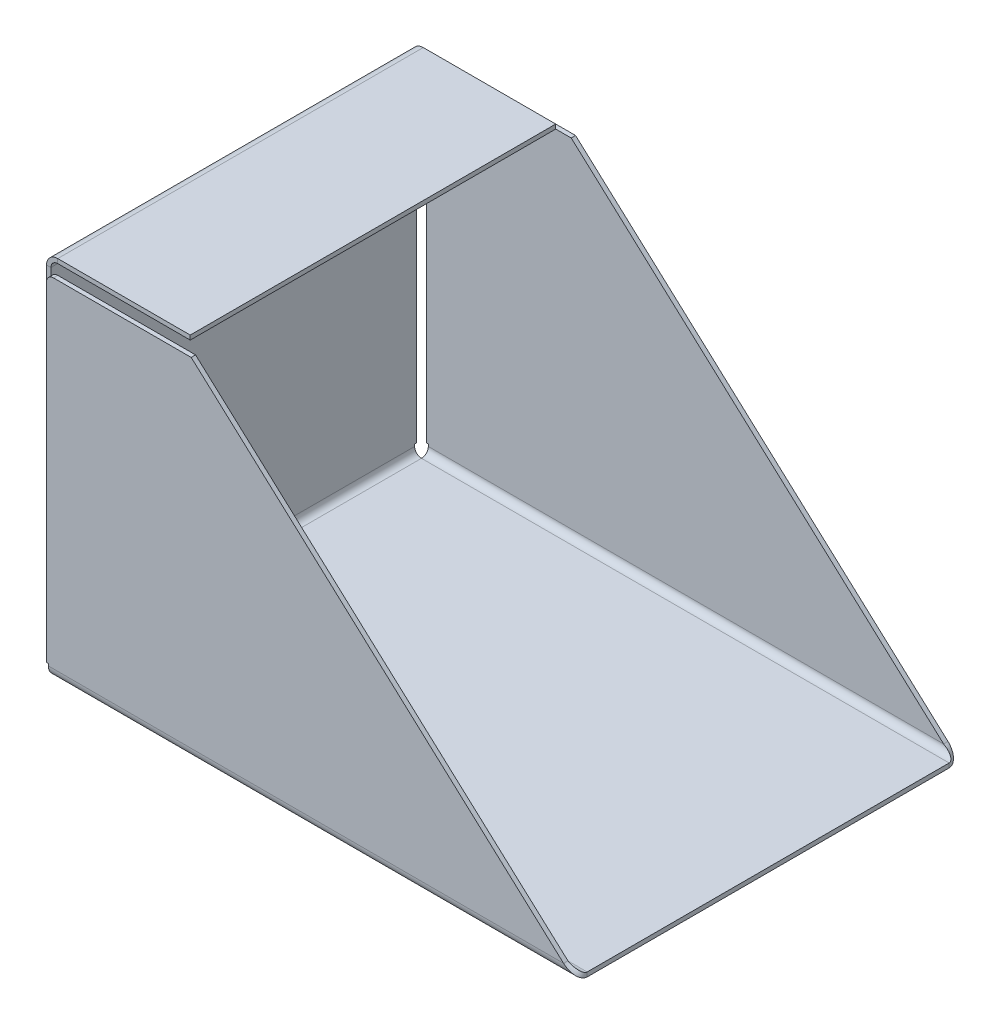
ISO-10303-21;
HEADER;
FILE_DESCRIPTION(('STEP AP214'),'2;1');
FILE_NAME('part.step','',(''),(''),'','','');
FILE_SCHEMA(('AUTOMOTIVE_DESIGN { 1 0 10303 214 1 1 1 1 }'));
ENDSEC;
DATA;
#1=APPLICATION_CONTEXT('core data for automotive mechanical design processes');
#2=APPLICATION_PROTOCOL_DEFINITION('international standard','automotive_design',2000,#1);
#3=PRODUCT_CONTEXT('',#1,'mechanical');
#4=PRODUCT('Part','Part','',(#3));
#5=PRODUCT_RELATED_PRODUCT_CATEGORY('part','',(#4));
#6=PRODUCT_DEFINITION_FORMATION('','',#4);
#7=PRODUCT_DEFINITION_CONTEXT('part definition',#1,'design');
#8=PRODUCT_DEFINITION('design','',#6,#7);
#9=PRODUCT_DEFINITION_SHAPE('','',#8);
#10=(LENGTH_UNIT() NAMED_UNIT(*) SI_UNIT(.MILLI.,.METRE.));
#11=(NAMED_UNIT(*) PLANE_ANGLE_UNIT() SI_UNIT($,.RADIAN.));
#12=(NAMED_UNIT(*) SI_UNIT($,.STERADIAN.) SOLID_ANGLE_UNIT());
#13=UNCERTAINTY_MEASURE_WITH_UNIT(LENGTH_MEASURE(1.E-05),#10,'distance_accuracy_value','');
#14=(GEOMETRIC_REPRESENTATION_CONTEXT(3) GLOBAL_UNCERTAINTY_ASSIGNED_CONTEXT((#13)) GLOBAL_UNIT_ASSIGNED_CONTEXT((#10,
#11,#12)) REPRESENTATION_CONTEXT('',''));
#15=CARTESIAN_POINT('',(0.,0.,0.));
#16=DIRECTION('',(0.,0.,1.));
#17=DIRECTION('',(1.,0.,0.));
#18=AXIS2_PLACEMENT_3D('',#15,#16,#17);
#19=CARTESIAN_POINT('',(3.11911999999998,3.11912,3.11912));
#20=DIRECTION('',(-1.,0.,0.));
#21=DIRECTION('',(0.,0.,1.));
#22=AXIS2_PLACEMENT_3D('',#19,#20,#21);
#23=PLANE('',#22);
#24=DIRECTION('',(0.,-1.,0.));
#25=VECTOR('',#24,1.);
#26=CARTESIAN_POINT('',(3.11911999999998,0.,3.11911999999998));
#27=LINE('',#26,#25);
#28=CARTESIAN_POINT('',(3.11911999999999,1.21412,3.11911999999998));
#29=VERTEX_POINT('',#28);
#30=CARTESIAN_POINT('',(3.11911999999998,0.,3.11911999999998));
#31=VERTEX_POINT('',#30);
#32=EDGE_CURVE('E11',#29,#31,#27,.T.);
#33=ORIENTED_EDGE('',*,*,#32,.F.);
#34=CARTESIAN_POINT('',(3.11911999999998,3.11912,3.11912));
#35=DIRECTION('',(-1.,0.,0.));
#36=DIRECTION('',(0.,0.,1.));
#37=AXIS2_PLACEMENT_3D('',#34,#35,#36);
#38=CIRCLE('',#37,1.905);
#39=CARTESIAN_POINT('',(3.11911999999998,3.11912,1.21412));
#40=VERTEX_POINT('',#39);
#41=EDGE_CURVE('E150',#29,#40,#38,.F.);
#42=ORIENTED_EDGE('',*,*,#41,.T.);
#43=DIRECTION('',(0.,0.,-1.));
#44=VECTOR('',#43,1.);
#45=CARTESIAN_POINT('',(3.11911999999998,3.11912,0.));
#46=LINE('',#45,#44);
#47=CARTESIAN_POINT('',(3.11911999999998,3.11912,0.));
#48=VERTEX_POINT('',#47);
#49=EDGE_CURVE('E44',#40,#48,#46,.T.);
#50=ORIENTED_EDGE('',*,*,#49,.T.);
#51=CARTESIAN_POINT('',(3.11911999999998,3.11912,3.11912));
#52=DIRECTION('',(1.,0.,0.));
#53=DIRECTION('',(0.,0.,-1.));
#54=AXIS2_PLACEMENT_3D('',#51,#52,#53);
#55=CIRCLE('',#54,3.11912);
#56=EDGE_CURVE('E153',#31,#48,#55,.T.);
#57=ORIENTED_EDGE('',*,*,#56,.F.);
#58=EDGE_LOOP('',(#33,#42,#50,#57));
#59=FACE_BOUND('',#58,.T.);
#60=ADVANCED_FACE('F34',(#59),#23,.T.);
#61=CARTESIAN_POINT('',(3.11911999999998,0.,0.));
#62=DIRECTION('',(1.,0.,0.));
#63=DIRECTION('',(0.,-1.,0.));
#64=AXIS2_PLACEMENT_3D('',#61,#62,#63);
#65=PLANE('',#64);
#66=ORIENTED_EDGE('',*,*,#49,.F.);
#67=DIRECTION('',(0.,1.,0.));
#68=VECTOR('',#67,1.);
#69=CARTESIAN_POINT('',(3.11911999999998,0.,1.21412));
#70=LINE('',#69,#68);
#71=CARTESIAN_POINT('',(3.11911999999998,3.716490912,1.21412));
#72=VERTEX_POINT('',#71);
#73=EDGE_CURVE('E350',#72,#40,#70,.F.);
#74=ORIENTED_EDGE('',*,*,#73,.F.);
#75=DIRECTION('',(0.,0.,-1.));
#76=VECTOR('',#75,1.);
#77=CARTESIAN_POINT('',(3.11911999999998,3.716490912,0.));
#78=LINE('',#77,#76);
#79=CARTESIAN_POINT('',(3.11911999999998,3.716490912,0.));
#80=VERTEX_POINT('',#79);
#81=EDGE_CURVE('E276',#72,#80,#78,.T.);
#82=ORIENTED_EDGE('',*,*,#81,.T.);
#83=DIRECTION('',(0.,-1.,0.));
#84=VECTOR('',#83,1.);
#85=CARTESIAN_POINT('',(3.11911999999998,0.,0.));
#86=LINE('',#85,#84);
#87=EDGE_CURVE('E299',#80,#48,#86,.T.);
#88=ORIENTED_EDGE('',*,*,#87,.T.);
#89=EDGE_LOOP('',(#66,#74,#82,#88));
#90=FACE_BOUND('',#89,.T.);
#91=ADVANCED_FACE('F300',(#90),#65,.F.);
#92=CARTESIAN_POINT('',(0.,3.716490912,0.));
#93=DIRECTION('',(0.,-1.,0.));
#94=DIRECTION('',(-1.,0.,0.));
#95=AXIS2_PLACEMENT_3D('',#92,#93,#94);
#96=PLANE('',#95);
#97=ORIENTED_EDGE('',*,*,#81,.F.);
#98=DIRECTION('',(-1.,0.,0.));
#99=VECTOR('',#98,1.);
#100=CARTESIAN_POINT('',(0.,3.716490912,1.21412));
#101=LINE('',#100,#99);
#102=CARTESIAN_POINT('',(2.62833356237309,3.71649091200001,1.21412));
#103=VERTEX_POINT('',#102);
#104=EDGE_CURVE('E384',#72,#103,#101,.T.);
#105=ORIENTED_EDGE('',*,*,#104,.T.);
#106=DIRECTION('',(0.,0.,-1.));
#107=VECTOR('',#106,1.);
#108=CARTESIAN_POINT('',(2.62833356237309,3.71649091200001,0.));
#109=LINE('',#108,#107);
#110=CARTESIAN_POINT('',(2.62833356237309,3.71649091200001,0.));
#111=VERTEX_POINT('',#110);
#112=EDGE_CURVE('E273',#103,#111,#109,.T.);
#113=ORIENTED_EDGE('',*,*,#112,.T.);
#114=DIRECTION('',(-1.,0.,0.));
#115=VECTOR('',#114,1.);
#116=CARTESIAN_POINT('',(0.,3.716490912,0.));
#117=LINE('',#116,#115);
#118=EDGE_CURVE('E306',#80,#111,#117,.T.);
#119=ORIENTED_EDGE('',*,*,#118,.F.);
#120=EDGE_LOOP('',(#97,#105,#113,#119));
#121=FACE_BOUND('',#120,.T.);
#122=ADVANCED_FACE('F422',(#121),#96,.T.);
#123=CARTESIAN_POINT('',(2.62833356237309,97.3716664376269,0.));
#124=DIRECTION('',(-1.,0.,0.));
#125=DIRECTION('',(0.,1.,0.));
#126=AXIS2_PLACEMENT_3D('',#123,#124,#125);
#127=PLANE('',#126);
#128=ORIENTED_EDGE('',*,*,#112,.F.);
#129=DIRECTION('',(0.,1.,0.));
#130=VECTOR('',#129,1.);
#131=CARTESIAN_POINT('',(2.62833356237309,0.,1.21412));
#132=LINE('',#131,#130);
#133=CARTESIAN_POINT('',(2.62833356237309,95.4666664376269,1.21412));
#134=VERTEX_POINT('',#133);
#135=EDGE_CURVE('E398',#103,#134,#132,.T.);
#136=ORIENTED_EDGE('',*,*,#135,.T.);
#137=DIRECTION('',(0.,0.,-1.));
#138=VECTOR('',#137,1.);
#139=CARTESIAN_POINT('',(2.62833356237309,95.4666664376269,0.));
#140=LINE('',#139,#138);
#141=CARTESIAN_POINT('',(2.62833356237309,95.4666664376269,0.));
#142=VERTEX_POINT('',#141);
#143=EDGE_CURVE('E270',#134,#142,#140,.T.);
#144=ORIENTED_EDGE('',*,*,#143,.T.);
#145=DIRECTION('',(0.,1.,0.));
#146=VECTOR('',#145,1.);
#147=CARTESIAN_POINT('',(2.62833356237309,97.3716664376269,0.));
#148=LINE('',#147,#146);
#149=EDGE_CURVE('E552',#111,#142,#148,.T.);
#150=ORIENTED_EDGE('',*,*,#149,.F.);
#151=EDGE_LOOP('',(#128,#136,#144,#150));
#152=FACE_BOUND('',#151,.T.);
#153=ADVANCED_FACE('F658',(#152),#127,.T.);
#154=CARTESIAN_POINT('',(4.53333356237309,95.4666664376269,0.));
#155=DIRECTION('',(0.,0.,-1.));
#156=DIRECTION('',(-1.,0.,0.));
#157=AXIS2_PLACEMENT_3D('',#154,#155,#156);
#158=CYLINDRICAL_SURFACE('',#157,1.905);
#159=ORIENTED_EDGE('',*,*,#143,.F.);
#160=CARTESIAN_POINT('',(4.53333356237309,95.4666664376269,1.21412));
#161=DIRECTION('',(0.,0.,-1.));
#162=DIRECTION('',(-1.,0.,0.));
#163=AXIS2_PLACEMENT_3D('',#160,#161,#162);
#164=CIRCLE('',#163,1.905);
#165=CARTESIAN_POINT('',(4.53333356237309,97.3716664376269,1.21412));
#166=VERTEX_POINT('',#165);
#167=EDGE_CURVE('E354',#134,#166,#164,.T.);
#168=ORIENTED_EDGE('',*,*,#167,.T.);
#169=DIRECTION('',(0.,0.,-1.));
#170=VECTOR('',#169,1.);
#171=CARTESIAN_POINT('',(4.53333356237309,97.3716664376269,0.));
#172=LINE('',#171,#170);
#173=CARTESIAN_POINT('',(4.53333356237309,97.3716664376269,0.));
#174=VERTEX_POINT('',#173);
#175=EDGE_CURVE('E267',#166,#174,#172,.T.);
#176=ORIENTED_EDGE('',*,*,#175,.T.);
#177=CARTESIAN_POINT('',(4.53333356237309,95.4666664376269,0.));
#178=DIRECTION('',(0.,0.,-1.));
#179=DIRECTION('',(-1.,0.,0.));
#180=AXIS2_PLACEMENT_3D('',#177,#178,#179);
#181=CIRCLE('',#180,1.905);
#182=EDGE_CURVE('E551',#142,#174,#181,.T.);
#183=ORIENTED_EDGE('',*,*,#182,.F.);
#184=EDGE_LOOP('',(#159,#168,#176,#183));
#185=FACE_BOUND('',#184,.T.);
#186=ADVANCED_FACE('F656',(#185),#158,.T.);
#187=CARTESIAN_POINT('',(40.,97.3716664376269,0.));
#188=DIRECTION('',(0.,1.,0.));
#189=DIRECTION('',(1.,0.,0.));
#190=AXIS2_PLACEMENT_3D('',#187,#188,#189);
#191=PLANE('',#190);
#192=ORIENTED_EDGE('',*,*,#175,.F.);
#193=DIRECTION('',(-1.,0.,0.));
#194=VECTOR('',#193,1.);
#195=CARTESIAN_POINT('',(0.,97.3716664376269,1.21412));
#196=LINE('',#195,#194);
#197=CARTESIAN_POINT('',(42.8911669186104,97.3716664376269,1.21412));
#198=VERTEX_POINT('',#197);
#199=EDGE_CURVE('E362',#166,#198,#196,.F.);
#200=ORIENTED_EDGE('',*,*,#199,.T.);
#201=DIRECTION('',(0.,0.,-1.));
#202=VECTOR('',#201,1.);
#203=CARTESIAN_POINT('',(42.8911669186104,97.3716664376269,0.));
#204=LINE('',#203,#202);
#205=CARTESIAN_POINT('',(42.8911669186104,97.3716664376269,0.));
#206=VERTEX_POINT('',#205);
#207=EDGE_CURVE('E264',#198,#206,#204,.T.);
#208=ORIENTED_EDGE('',*,*,#207,.T.);
#209=DIRECTION('',(1.,0.,0.));
#210=VECTOR('',#209,1.);
#211=CARTESIAN_POINT('',(40.,97.3716664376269,0.));
#212=LINE('',#211,#210);
#213=EDGE_CURVE('E542',#174,#206,#212,.T.);
#214=ORIENTED_EDGE('',*,*,#213,.F.);
#215=EDGE_LOOP('',(#192,#200,#208,#214));
#216=FACE_BOUND('',#215,.T.);
#217=ADVANCED_FACE('F652',(#216),#191,.T.);
#218=CARTESIAN_POINT('',(40.,100.,0.));
#219=DIRECTION('',(-0.672672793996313,-0.739940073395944,0.));
#220=DIRECTION('',(-0.739940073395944,0.672672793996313,0.));
#221=AXIS2_PLACEMENT_3D('',#218,#219,#220);
#222=PLANE('',#221);
#223=ORIENTED_EDGE('',*,*,#207,.F.);
#224=DIRECTION('',(-0.739940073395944,0.672672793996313,0.));
#225=VECTOR('',#224,1.);
#226=CARTESIAN_POINT('',(40.,100.,1.21412));
#227=LINE('',#226,#225);
#228=CARTESIAN_POINT('',(146.568968,3.11912000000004,1.21412));
#229=VERTEX_POINT('',#228);
#230=EDGE_CURVE('E366',#229,#198,#227,.T.);
#231=ORIENTED_EDGE('',*,*,#230,.F.);
#232=DIRECTION('',(0.,0.,-1.));
#233=VECTOR('',#232,1.);
#234=CARTESIAN_POINT('',(146.568968,3.11912000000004,0.));
#235=LINE('',#234,#233);
#236=CARTESIAN_POINT('',(146.568968,3.11912000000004,0.));
#237=VERTEX_POINT('',#236);
#238=EDGE_CURVE('E261',#229,#237,#235,.T.);
#239=ORIENTED_EDGE('',*,*,#238,.T.);
#240=DIRECTION('',(-0.739940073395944,0.672672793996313,0.));
#241=VECTOR('',#240,1.);
#242=CARTESIAN_POINT('',(40.,100.,0.));
#243=LINE('',#242,#241);
#244=EDGE_CURVE('E312',#237,#206,#243,.T.);
#245=ORIENTED_EDGE('',*,*,#244,.T.);
#246=EDGE_LOOP('',(#223,#231,#239,#245));
#247=FACE_BOUND('',#246,.T.);
#248=ADVANCED_FACE('F649',(#247),#222,.F.);
#249=CARTESIAN_POINT('',(143.137936,6.23824,3.11912));
#250=CARTESIAN_POINT('',(143.137936,5.83353333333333,3.11912));
#251=CARTESIAN_POINT('',(143.137936,5.42882666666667,3.11912));
#252=CARTESIAN_POINT('',(143.137936,5.02412,3.11912));
#253=CARTESIAN_POINT('',(143.137936,6.23824,-3.11912));
#254=CARTESIAN_POINT('',(143.137936,5.83353333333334,-2.30970666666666));
#255=CARTESIAN_POINT('',(143.137936,5.42882666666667,-1.50029333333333));
#256=CARTESIAN_POINT('',(143.137936,5.02412,-0.690879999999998));
#257=CARTESIAN_POINT('',(150.,0.,-3.11912));
#258=CARTESIAN_POINT('',(150.,0.404706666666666,-2.30970666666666));
#259=CARTESIAN_POINT('',(150.,0.809413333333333,-1.50029333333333));
#260=CARTESIAN_POINT('',(150.,1.21412,-0.690879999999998));
#261=CARTESIAN_POINT('',(150.,0.,3.11912));
#262=CARTESIAN_POINT('',(150.,0.404706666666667,3.11912));
#263=CARTESIAN_POINT('',(150.,0.809413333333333,3.11912));
#264=CARTESIAN_POINT('',(150.,1.21412,3.11912));
#265=CARTESIAN_POINT('',(150.,0.,9.35736));
#266=CARTESIAN_POINT('',(150.,0.404706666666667,8.54794666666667));
#267=CARTESIAN_POINT('',(150.,0.809413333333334,7.73853333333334));
#268=CARTESIAN_POINT('',(150.,1.21412,6.92912));
#269=CARTESIAN_POINT('',(143.137936,6.23824,9.35736));
#270=CARTESIAN_POINT('',(143.137936,5.83353333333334,8.54794666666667));
#271=CARTESIAN_POINT('',(143.137936,5.42882666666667,7.73853333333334));
#272=CARTESIAN_POINT('',(143.137936,5.02412,6.92912));
#273=CARTESIAN_POINT('',(143.137936,6.23824,3.11912));
#274=CARTESIAN_POINT('',(143.137936,5.83353333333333,3.11912));
#275=CARTESIAN_POINT('',(143.137936,5.42882666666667,3.11912));
#276=CARTESIAN_POINT('',(143.137936,5.02412,3.11912));
#277=(BOUNDED_SURFACE() B_SPLINE_SURFACE(3,3,((#249,#250,#251,#252),(#253,#254,#255,#256),(#257,
#258,#259,#260),(#261,#262,#263,#264),(#265,#266,#267,#268),(#269,#270,#271,#272),(#273,#274,
#275,#276)),.UNSPECIFIED.,.T.,.F.,.F.) B_SPLINE_SURFACE_WITH_KNOTS((4,3,4),(4,4),(0.,0.5,1.),
(0.,1.),.UNSPECIFIED.) GEOMETRIC_REPRESENTATION_ITEM() RATIONAL_B_SPLINE_SURFACE(((1.,1.,1.,1.),
(0.333333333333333,0.333333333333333,0.333333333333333,0.333333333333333),(0.333333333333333,
0.333333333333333,0.333333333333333,0.333333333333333),(1.,1.,1.,1.),(0.333333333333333,
0.333333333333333,0.333333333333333,0.333333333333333),(0.333333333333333,0.333333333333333,
0.333333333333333,0.333333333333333),(1.,1.,1.,1.))) REPRESENTATION_ITEM('') SURFACE());
#278=CARTESIAN_POINT('',(146.568968,3.11912,3.11912));
#279=DIRECTION('',(0.48542310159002,0.874279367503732,0.));
#280=DIRECTION('',(-0.874279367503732,0.48542310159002,0.));
#281=AXIS2_PLACEMENT_3D('',#278,#279,#280);
#282=ELLIPSE('',#281,3.92441149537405,1.905);
#283=CARTESIAN_POINT('',(150.,1.21412,3.11912));
#284=VERTEX_POINT('',#283);
#285=EDGE_CURVE('E191',#229,#284,#282,.F.);
#286=DIRECTION('',(0.,-1.,0.));
#287=VECTOR('',#286,1.);
#288=CARTESIAN_POINT('',(150.,0.,3.11912));
#289=LINE('',#288,#287);
#290=CARTESIAN_POINT('',(150.,0.,3.11912));
#291=VERTEX_POINT('',#290);
#292=EDGE_CURVE('E258',#284,#291,#289,.T.);
#293=CARTESIAN_POINT('',(146.568968,3.11912,3.11912));
#294=DIRECTION('',(0.672672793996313,0.739940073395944,0.));
#295=DIRECTION('',(-0.739940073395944,0.672672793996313,0.));
#296=AXIS2_PLACEMENT_3D('',#293,#294,#295);
#297=ELLIPSE('',#296,4.63690523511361,3.11912);
#298=EDGE_CURVE('E296',#237,#291,#297,.F.);
#299=ORIENTED_EDGE('',*,*,#238,.F.);
#300=ORIENTED_EDGE('',*,*,#285,.T.);
#301=ORIENTED_EDGE('',*,*,#292,.T.);
#302=ORIENTED_EDGE('',*,*,#298,.F.);
#303=EDGE_LOOP('',(#299,#300,#301,#302));
#304=FACE_BOUND('',#303,.T.);
#305=ADVANCED_FACE('F646',(#304),#277,.F.);
#306=CARTESIAN_POINT('',(150.,0.,107.));
#307=DIRECTION('',(1.,0.,0.));
#308=DIRECTION('',(0.,0.,-1.));
#309=AXIS2_PLACEMENT_3D('',#306,#307,#308);
#310=PLANE('',#309);
#311=ORIENTED_EDGE('',*,*,#292,.F.);
#312=DIRECTION('',(0.,0.,1.));
#313=VECTOR('',#312,1.);
#314=CARTESIAN_POINT('',(150.,1.21412,107.));
#315=LINE('',#314,#313);
#316=CARTESIAN_POINT('',(150.,1.21412,103.88088));
#317=VERTEX_POINT('',#316);
#318=EDGE_CURVE('E181',#317,#284,#315,.F.);
#319=ORIENTED_EDGE('',*,*,#318,.F.);
#320=DIRECTION('',(0.,-1.,0.));
#321=VECTOR('',#320,1.);
#322=CARTESIAN_POINT('',(150.,0.,103.88088));
#323=LINE('',#322,#321);
#324=CARTESIAN_POINT('',(150.,0.,103.88088));
#325=VERTEX_POINT('',#324);
#326=EDGE_CURVE('E52',#317,#325,#323,.T.);
#327=ORIENTED_EDGE('',*,*,#326,.T.);
#328=DIRECTION('',(0.,0.,-1.));
#329=VECTOR('',#328,1.);
#330=CARTESIAN_POINT('',(150.,0.,107.));
#331=LINE('',#330,#329);
#332=EDGE_CURVE('E531',#325,#291,#331,.T.);
#333=ORIENTED_EDGE('',*,*,#332,.T.);
#334=EDGE_LOOP('',(#311,#319,#327,#333));
#335=FACE_BOUND('',#334,.T.);
#336=ADVANCED_FACE('F644',(#335),#310,.T.);
#337=CARTESIAN_POINT('',(150.,1.21412,103.88088));
#338=CARTESIAN_POINT('',(150.,0.809413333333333,103.88088));
#339=CARTESIAN_POINT('',(150.,0.404706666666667,103.88088));
#340=CARTESIAN_POINT('',(150.,0.,103.88088));
#341=CARTESIAN_POINT('',(150.,1.21412,107.69088));
#342=CARTESIAN_POINT('',(150.,0.809413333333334,108.500293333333));
#343=CARTESIAN_POINT('',(150.,0.404706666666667,109.309706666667));
#344=CARTESIAN_POINT('',(150.,0.,110.11912));
#345=CARTESIAN_POINT('',(143.137936,5.02412,107.69088));
#346=CARTESIAN_POINT('',(143.137936,5.42882666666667,108.500293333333));
#347=CARTESIAN_POINT('',(143.137936,5.83353333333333,109.309706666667));
#348=CARTESIAN_POINT('',(143.137936,6.23824,110.11912));
#349=CARTESIAN_POINT('',(143.137936,5.02412,103.88088));
#350=CARTESIAN_POINT('',(143.137936,5.42882666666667,103.88088));
#351=CARTESIAN_POINT('',(143.137936,5.83353333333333,103.88088));
#352=CARTESIAN_POINT('',(143.137936,6.23824,103.88088));
#353=CARTESIAN_POINT('',(143.137936,5.02412,100.07088));
#354=CARTESIAN_POINT('',(143.137936,5.42882666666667,99.2614666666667));
#355=CARTESIAN_POINT('',(143.137936,5.83353333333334,98.4520533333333));
#356=CARTESIAN_POINT('',(143.137936,6.23824,97.64264));
#357=CARTESIAN_POINT('',(150.,1.21412,100.07088));
#358=CARTESIAN_POINT('',(150.,0.809413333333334,99.2614666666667));
#359=CARTESIAN_POINT('',(150.,0.404706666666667,98.4520533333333));
#360=CARTESIAN_POINT('',(150.,0.,97.64264));
#361=CARTESIAN_POINT('',(150.,1.21412,103.88088));
#362=CARTESIAN_POINT('',(150.,0.809413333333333,103.88088));
#363=CARTESIAN_POINT('',(150.,0.404706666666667,103.88088));
#364=CARTESIAN_POINT('',(150.,0.,103.88088));
#365=(BOUNDED_SURFACE() B_SPLINE_SURFACE(3,3,((#337,#338,#339,#340),(#341,#342,#343,#344),(#345,
#346,#347,#348),(#349,#350,#351,#352),(#353,#354,#355,#356),(#357,#358,#359,#360),(#361,#362,
#363,#364)),.UNSPECIFIED.,.T.,.F.,.F.) B_SPLINE_SURFACE_WITH_KNOTS((4,3,4),(4,4),(0.,0.5,1.),
(0.,1.),.UNSPECIFIED.) GEOMETRIC_REPRESENTATION_ITEM() RATIONAL_B_SPLINE_SURFACE(((1.,1.,1.,1.),
(0.333333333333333,0.333333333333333,0.333333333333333,0.333333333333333),(0.333333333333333,
0.333333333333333,0.333333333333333,0.333333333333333),(1.,1.,1.,1.),(0.333333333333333,
0.333333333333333,0.333333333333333,0.333333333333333),(0.333333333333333,0.333333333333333,
0.333333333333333,0.333333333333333),(1.,1.,1.,1.))) REPRESENTATION_ITEM('') SURFACE());
#366=CARTESIAN_POINT('',(146.568968,3.11912,103.88088));
#367=DIRECTION('',(-0.48542310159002,-0.874279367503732,0.));
#368=DIRECTION('',(0.874279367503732,-0.48542310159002,0.));
#369=AXIS2_PLACEMENT_3D('',#366,#367,#368);
#370=ELLIPSE('',#369,3.92441149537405,1.905);
#371=CARTESIAN_POINT('',(146.568968,3.11912000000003,105.78588));
#372=VERTEX_POINT('',#371);
#373=EDGE_CURVE('E388',#317,#372,#370,.T.);
#374=DIRECTION('',(0.,0.,1.));
#375=VECTOR('',#374,1.);
#376=CARTESIAN_POINT('',(146.568968,3.11912000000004,107.));
#377=LINE('',#376,#375);
#378=CARTESIAN_POINT('',(146.568968,3.11912000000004,107.));
#379=VERTEX_POINT('',#378);
#380=EDGE_CURVE('E255',#372,#379,#377,.T.);
#381=CARTESIAN_POINT('',(146.568968,3.11912,103.88088));
#382=DIRECTION('',(-0.672672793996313,-0.739940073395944,0.));
#383=DIRECTION('',(0.739940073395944,-0.672672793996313,0.));
#384=AXIS2_PLACEMENT_3D('',#381,#382,#383);
#385=ELLIPSE('',#384,4.63690523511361,3.11912);
#386=EDGE_CURVE('E327',#325,#379,#385,.T.);
#387=ORIENTED_EDGE('',*,*,#326,.F.);
#388=ORIENTED_EDGE('',*,*,#373,.T.);
#389=ORIENTED_EDGE('',*,*,#380,.T.);
#390=ORIENTED_EDGE('',*,*,#386,.F.);
#391=EDGE_LOOP('',(#387,#388,#389,#390));
#392=FACE_BOUND('',#391,.T.);
#393=ADVANCED_FACE('F732',(#392),#365,.T.);
#394=CARTESIAN_POINT('',(40.,100.,107.));
#395=DIRECTION('',(-0.672672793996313,-0.739940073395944,0.));
#396=DIRECTION('',(-0.739940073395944,0.672672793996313,0.));
#397=AXIS2_PLACEMENT_3D('',#394,#395,#396);
#398=PLANE('',#397);
#399=ORIENTED_EDGE('',*,*,#380,.F.);
#400=DIRECTION('',(-0.739940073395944,0.672672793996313,0.));
#401=VECTOR('',#400,1.);
#402=CARTESIAN_POINT('',(40.,100.,105.78588));
#403=LINE('',#402,#401);
#404=CARTESIAN_POINT('',(42.8911669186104,97.3716664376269,105.78588));
#405=VERTEX_POINT('',#404);
#406=EDGE_CURVE('E372',#372,#405,#403,.T.);
#407=ORIENTED_EDGE('',*,*,#406,.T.);
#408=DIRECTION('',(0.,0.,1.));
#409=VECTOR('',#408,1.);
#410=CARTESIAN_POINT('',(42.8911669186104,97.3716664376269,107.));
#411=LINE('',#410,#409);
#412=CARTESIAN_POINT('',(42.8911669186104,97.3716664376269,107.));
#413=VERTEX_POINT('',#412);
#414=EDGE_CURVE('E252',#405,#413,#411,.T.);
#415=ORIENTED_EDGE('',*,*,#414,.T.);
#416=DIRECTION('',(-0.739940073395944,0.672672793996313,0.));
#417=VECTOR('',#416,1.);
#418=CARTESIAN_POINT('',(40.,100.,107.));
#419=LINE('',#418,#417);
#420=EDGE_CURVE('E453',#379,#413,#419,.T.);
#421=ORIENTED_EDGE('',*,*,#420,.F.);
#422=EDGE_LOOP('',(#399,#407,#415,#421));
#423=FACE_BOUND('',#422,.T.);
#424=ADVANCED_FACE('F527',(#423),#398,.F.);
#425=CARTESIAN_POINT('',(0.,97.3716664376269,107.));
#426=DIRECTION('',(0.,-1.,0.));
#427=DIRECTION('',(-1.,0.,0.));
#428=AXIS2_PLACEMENT_3D('',#425,#426,#427);
#429=PLANE('',#428);
#430=ORIENTED_EDGE('',*,*,#414,.F.);
#431=DIRECTION('',(-1.,0.,0.));
#432=VECTOR('',#431,1.);
#433=CARTESIAN_POINT('',(0.,97.3716664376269,105.78588));
#434=LINE('',#433,#432);
#435=CARTESIAN_POINT('',(4.53333356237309,97.3716664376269,105.78588));
#436=VERTEX_POINT('',#435);
#437=EDGE_CURVE('E369',#405,#436,#434,.T.);
#438=ORIENTED_EDGE('',*,*,#437,.T.);
#439=DIRECTION('',(0.,0.,1.));
#440=VECTOR('',#439,1.);
#441=CARTESIAN_POINT('',(4.53333356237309,97.3716664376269,107.));
#442=LINE('',#441,#440);
#443=CARTESIAN_POINT('',(4.53333356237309,97.3716664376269,107.));
#444=VERTEX_POINT('',#443);
#445=EDGE_CURVE('E249',#436,#444,#442,.T.);
#446=ORIENTED_EDGE('',*,*,#445,.T.);
#447=DIRECTION('',(-1.,0.,0.));
#448=VECTOR('',#447,1.);
#449=CARTESIAN_POINT('',(0.,97.3716664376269,107.));
#450=LINE('',#449,#448);
#451=EDGE_CURVE('E544',#413,#444,#450,.T.);
#452=ORIENTED_EDGE('',*,*,#451,.F.);
#453=EDGE_LOOP('',(#430,#438,#446,#452));
#454=FACE_BOUND('',#453,.T.);
#455=ADVANCED_FACE('F751',(#454),#429,.F.);
#456=CARTESIAN_POINT('',(4.53333356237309,95.4666664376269,107.));
#457=DIRECTION('',(0.,0.,-1.));
#458=DIRECTION('',(-1.,0.,0.));
#459=AXIS2_PLACEMENT_3D('',#456,#457,#458);
#460=CYLINDRICAL_SURFACE('',#459,1.905);
#461=ORIENTED_EDGE('',*,*,#445,.F.);
#462=CARTESIAN_POINT('',(4.53333356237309,95.4666664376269,105.78588));
#463=DIRECTION('',(0.,0.,-1.));
#464=DIRECTION('',(-1.,0.,0.));
#465=AXIS2_PLACEMENT_3D('',#462,#463,#464);
#466=CIRCLE('',#465,1.905);
#467=CARTESIAN_POINT('',(2.6283335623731,95.4666664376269,105.78588));
#468=VERTEX_POINT('',#467);
#469=EDGE_CURVE('E395',#436,#468,#466,.F.);
#470=ORIENTED_EDGE('',*,*,#469,.T.);
#471=DIRECTION('',(0.,0.,1.));
#472=VECTOR('',#471,1.);
#473=CARTESIAN_POINT('',(2.6283335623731,95.4666664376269,107.));
#474=LINE('',#473,#472);
#475=CARTESIAN_POINT('',(2.6283335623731,95.4666664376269,107.));
#476=VERTEX_POINT('',#475);
#477=EDGE_CURVE('E246',#468,#476,#474,.T.);
#478=ORIENTED_EDGE('',*,*,#477,.T.);
#479=CARTESIAN_POINT('',(4.53333356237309,95.4666664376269,107.));
#480=DIRECTION('',(0.,0.,-1.));
#481=DIRECTION('',(-1.,0.,0.));
#482=AXIS2_PLACEMENT_3D('',#479,#480,#481);
#483=CIRCLE('',#482,1.905);
#484=EDGE_CURVE('E554',#444,#476,#483,.F.);
#485=ORIENTED_EDGE('',*,*,#484,.F.);
#486=EDGE_LOOP('',(#461,#470,#478,#485));
#487=FACE_BOUND('',#486,.T.);
#488=ADVANCED_FACE('F762',(#487),#460,.T.);
#489=CARTESIAN_POINT('',(2.6283335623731,0.,107.));
#490=DIRECTION('',(1.,0.,0.));
#491=DIRECTION('',(0.,-1.,0.));
#492=AXIS2_PLACEMENT_3D('',#489,#490,#491);
#493=PLANE('',#492);
#494=ORIENTED_EDGE('',*,*,#477,.F.);
#495=DIRECTION('',(0.,1.,0.));
#496=VECTOR('',#495,1.);
#497=CARTESIAN_POINT('',(2.6283335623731,0.,105.78588));
#498=LINE('',#497,#496);
#499=CARTESIAN_POINT('',(2.6283335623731,3.716490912,105.78588));
#500=VERTEX_POINT('',#499);
#501=EDGE_CURVE('E377',#468,#500,#498,.F.);
#502=ORIENTED_EDGE('',*,*,#501,.T.);
#503=DIRECTION('',(0.,0.,1.));
#504=VECTOR('',#503,1.);
#505=CARTESIAN_POINT('',(2.6283335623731,3.716490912,107.));
#506=LINE('',#505,#504);
#507=CARTESIAN_POINT('',(2.6283335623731,3.716490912,107.));
#508=VERTEX_POINT('',#507);
#509=EDGE_CURVE('E243',#500,#508,#506,.T.);
#510=ORIENTED_EDGE('',*,*,#509,.T.);
#511=DIRECTION('',(0.,-1.,0.));
#512=VECTOR('',#511,1.);
#513=CARTESIAN_POINT('',(2.6283335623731,0.,107.));
#514=LINE('',#513,#512);
#515=EDGE_CURVE('E555',#476,#508,#514,.T.);
#516=ORIENTED_EDGE('',*,*,#515,.F.);
#517=EDGE_LOOP('',(#494,#502,#510,#516));
#518=FACE_BOUND('',#517,.T.);
#519=ADVANCED_FACE('F773',(#518),#493,.F.);
#520=CARTESIAN_POINT('',(0.,3.716490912,107.));
#521=DIRECTION('',(0.,1.,0.));
#522=DIRECTION('',(1.,0.,0.));
#523=AXIS2_PLACEMENT_3D('',#520,#521,#522);
#524=PLANE('',#523);
#525=ORIENTED_EDGE('',*,*,#509,.F.);
#526=DIRECTION('',(-1.,0.,0.));
#527=VECTOR('',#526,1.);
#528=CARTESIAN_POINT('',(0.,3.716490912,105.78588));
#529=LINE('',#528,#527);
#530=CARTESIAN_POINT('',(3.11911999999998,3.716490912,105.78588));
#531=VERTEX_POINT('',#530);
#532=EDGE_CURVE('E376',#500,#531,#529,.F.);
#533=ORIENTED_EDGE('',*,*,#532,.T.);
#534=DIRECTION('',(0.,0.,1.));
#535=VECTOR('',#534,1.);
#536=CARTESIAN_POINT('',(3.11911999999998,3.716490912,107.));
#537=LINE('',#536,#535);
#538=CARTESIAN_POINT('',(3.11911999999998,3.716490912,107.));
#539=VERTEX_POINT('',#538);
#540=EDGE_CURVE('E240',#531,#539,#537,.T.);
#541=ORIENTED_EDGE('',*,*,#540,.T.);
#542=DIRECTION('',(1.,0.,0.));
#543=VECTOR('',#542,1.);
#544=CARTESIAN_POINT('',(0.,3.716490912,107.));
#545=LINE('',#544,#543);
#546=EDGE_CURVE('E517',#508,#539,#545,.T.);
#547=ORIENTED_EDGE('',*,*,#546,.F.);
#548=EDGE_LOOP('',(#525,#533,#541,#547));
#549=FACE_BOUND('',#548,.T.);
#550=ADVANCED_FACE('F633',(#549),#524,.F.);
#551=CARTESIAN_POINT('',(3.11911999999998,0.,107.));
#552=DIRECTION('',(-1.,0.,0.));
#553=DIRECTION('',(0.,1.,0.));
#554=AXIS2_PLACEMENT_3D('',#551,#552,#553);
#555=PLANE('',#554);
#556=ORIENTED_EDGE('',*,*,#540,.F.);
#557=DIRECTION('',(0.,1.,0.));
#558=VECTOR('',#557,1.);
#559=CARTESIAN_POINT('',(3.11911999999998,0.,105.78588));
#560=LINE('',#559,#558);
#561=CARTESIAN_POINT('',(3.11911999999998,3.11912,105.78588));
#562=VERTEX_POINT('',#561);
#563=EDGE_CURVE('E382',#562,#531,#560,.T.);
#564=ORIENTED_EDGE('',*,*,#563,.F.);
#565=DIRECTION('',(0.,0.,1.));
#566=VECTOR('',#565,1.);
#567=CARTESIAN_POINT('',(3.11911999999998,3.11912,107.));
#568=LINE('',#567,#566);
#569=CARTESIAN_POINT('',(3.11911999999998,3.11912,107.));
#570=VERTEX_POINT('',#569);
#571=EDGE_CURVE('E237',#562,#570,#568,.T.);
#572=ORIENTED_EDGE('',*,*,#571,.T.);
#573=DIRECTION('',(0.,1.,0.));
#574=VECTOR('',#573,1.);
#575=CARTESIAN_POINT('',(3.11911999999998,0.,107.));
#576=LINE('',#575,#574);
#577=EDGE_CURVE('E506',#570,#539,#576,.T.);
#578=ORIENTED_EDGE('',*,*,#577,.T.);
#579=EDGE_LOOP('',(#556,#564,#572,#578));
#580=FACE_BOUND('',#579,.T.);
#581=ADVANCED_FACE('F504',(#580),#555,.T.);
#582=CARTESIAN_POINT('',(3.11911999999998,3.11912,103.88088));
#583=DIRECTION('',(1.,0.,0.));
#584=DIRECTION('',(0.,0.,-1.));
#585=AXIS2_PLACEMENT_3D('',#582,#583,#584);
#586=PLANE('',#585);
#587=ORIENTED_EDGE('',*,*,#571,.F.);
#588=CARTESIAN_POINT('',(3.11911999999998,3.11912,103.88088));
#589=DIRECTION('',(1.,0.,0.));
#590=DIRECTION('',(0.,0.,-1.));
#591=AXIS2_PLACEMENT_3D('',#588,#589,#590);
#592=CIRCLE('',#591,1.905);
#593=CARTESIAN_POINT('',(3.11911999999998,1.21412,103.88088));
#594=VERTEX_POINT('',#593);
#595=EDGE_CURVE('E386',#562,#594,#592,.T.);
#596=ORIENTED_EDGE('',*,*,#595,.T.);
#597=DIRECTION('',(0.,-1.,0.));
#598=VECTOR('',#597,1.);
#599=CARTESIAN_POINT('',(3.11911999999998,0.,103.88088));
#600=LINE('',#599,#598);
#601=CARTESIAN_POINT('',(3.11911999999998,0.,103.88088));
#602=VERTEX_POINT('',#601);
#603=EDGE_CURVE('E234',#594,#602,#600,.T.);
#604=ORIENTED_EDGE('',*,*,#603,.T.);
#605=CARTESIAN_POINT('',(3.11911999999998,3.11912,103.88088));
#606=DIRECTION('',(-1.,0.,0.));
#607=DIRECTION('',(0.,0.,1.));
#608=AXIS2_PLACEMENT_3D('',#605,#606,#607);
#609=CIRCLE('',#608,3.11912);
#610=EDGE_CURVE('E323',#570,#602,#609,.F.);
#611=ORIENTED_EDGE('',*,*,#610,.F.);
#612=EDGE_LOOP('',(#587,#596,#604,#611));
#613=FACE_BOUND('',#612,.T.);
#614=ADVANCED_FACE('F519',(#613),#586,.F.);
#615=CARTESIAN_POINT('',(3.11912,3.11912,103.88088));
#616=DIRECTION('',(0.,0.,-1.));
#617=DIRECTION('',(-1.,0.,0.));
#618=AXIS2_PLACEMENT_3D('',#615,#616,#617);
#619=PLANE('',#618);
#620=ORIENTED_EDGE('',*,*,#603,.F.);
#621=CARTESIAN_POINT('',(3.11912,3.11912,103.88088));
#622=DIRECTION('',(0.,0.,-1.));
#623=DIRECTION('',(-1.,0.,0.));
#624=AXIS2_PLACEMENT_3D('',#621,#622,#623);
#625=CIRCLE('',#624,1.905);
#626=CARTESIAN_POINT('',(1.21412,3.11912,103.88088));
#627=VERTEX_POINT('',#626);
#628=EDGE_CURVE('E170',#594,#627,#625,.T.);
#629=ORIENTED_EDGE('',*,*,#628,.T.);
#630=DIRECTION('',(-1.,0.,0.));
#631=VECTOR('',#630,1.);
#632=CARTESIAN_POINT('',(0.,3.11912,103.88088));
#633=LINE('',#632,#631);
#634=CARTESIAN_POINT('',(0.,3.11912,103.88088));
#635=VERTEX_POINT('',#634);
#636=EDGE_CURVE('E231',#627,#635,#633,.T.);
#637=ORIENTED_EDGE('',*,*,#636,.T.);
#638=CARTESIAN_POINT('',(3.11912,3.11912,103.88088));
#639=DIRECTION('',(0.,0.,1.));
#640=DIRECTION('',(1.,0.,0.));
#641=AXIS2_PLACEMENT_3D('',#638,#639,#640);
#642=CIRCLE('',#641,3.11912);
#643=EDGE_CURVE('E450',#602,#635,#642,.F.);
#644=ORIENTED_EDGE('',*,*,#643,.F.);
#645=EDGE_LOOP('',(#620,#629,#637,#644));
#646=FACE_BOUND('',#645,.T.);
#647=ADVANCED_FACE('F814',(#646),#619,.F.);
#648=CARTESIAN_POINT('',(0.,0.,103.88088));
#649=DIRECTION('',(0.,0.,1.));
#650=DIRECTION('',(0.,-1.,0.));
#651=AXIS2_PLACEMENT_3D('',#648,#649,#650);
#652=PLANE('',#651);
#653=ORIENTED_EDGE('',*,*,#636,.F.);
#654=DIRECTION('',(0.,1.,0.));
#655=VECTOR('',#654,1.);
#656=CARTESIAN_POINT('',(1.21412,0.,103.88088));
#657=LINE('',#656,#655);
#658=CARTESIAN_POINT('',(1.21412,3.716490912,103.88088));
#659=VERTEX_POINT('',#658);
#660=EDGE_CURVE('E381',#659,#627,#657,.F.);
#661=ORIENTED_EDGE('',*,*,#660,.F.);
#662=DIRECTION('',(-1.,0.,0.));
#663=VECTOR('',#662,1.);
#664=CARTESIAN_POINT('',(0.,3.716490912,103.88088));
#665=LINE('',#664,#663);
#666=CARTESIAN_POINT('',(0.,3.716490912,103.88088));
#667=VERTEX_POINT('',#666);
#668=EDGE_CURVE('E228',#659,#667,#665,.T.);
#669=ORIENTED_EDGE('',*,*,#668,.T.);
#670=DIRECTION('',(0.,-1.,0.));
#671=VECTOR('',#670,1.);
#672=CARTESIAN_POINT('',(0.,0.,103.88088));
#673=LINE('',#672,#671);
#674=EDGE_CURVE('E427',#667,#635,#673,.T.);
#675=ORIENTED_EDGE('',*,*,#674,.T.);
#676=EDGE_LOOP('',(#653,#661,#669,#675));
#677=FACE_BOUND('',#676,.T.);
#678=ADVANCED_FACE('F470',(#677),#652,.T.);
#679=CARTESIAN_POINT('',(0.,3.716490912,107.));
#680=DIRECTION('',(0.,1.,0.));
#681=DIRECTION('',(0.,0.,1.));
#682=AXIS2_PLACEMENT_3D('',#679,#680,#681);
#683=PLANE('',#682);
#684=ORIENTED_EDGE('',*,*,#668,.F.);
#685=DIRECTION('',(0.,0.,-1.));
#686=VECTOR('',#685,1.);
#687=CARTESIAN_POINT('',(1.21412,3.716490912,107.));
#688=LINE('',#687,#686);
#689=CARTESIAN_POINT('',(1.21412,3.716490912,104.371666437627));
#690=VERTEX_POINT('',#689);
#691=EDGE_CURVE('E378',#659,#690,#688,.F.);
#692=ORIENTED_EDGE('',*,*,#691,.T.);
#693=DIRECTION('',(-1.,0.,0.));
#694=VECTOR('',#693,1.);
#695=CARTESIAN_POINT('',(0.,3.716490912,104.371666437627));
#696=LINE('',#695,#694);
#697=CARTESIAN_POINT('',(0.,3.716490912,104.371666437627));
#698=VERTEX_POINT('',#697);
#699=EDGE_CURVE('E225',#690,#698,#696,.T.);
#700=ORIENTED_EDGE('',*,*,#699,.T.);
#701=DIRECTION('',(0.,0.,1.));
#702=VECTOR('',#701,1.);
#703=CARTESIAN_POINT('',(0.,3.716490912,107.));
#704=LINE('',#703,#702);
#705=EDGE_CURVE('E430',#667,#698,#704,.T.);
#706=ORIENTED_EDGE('',*,*,#705,.F.);
#707=EDGE_LOOP('',(#684,#692,#700,#706));
#708=FACE_BOUND('',#707,.T.);
#709=ADVANCED_FACE('F833',(#708),#683,.F.);
#710=CARTESIAN_POINT('',(0.,0.,104.371666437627));
#711=DIRECTION('',(0.,0.,-1.));
#712=DIRECTION('',(0.,1.,0.));
#713=AXIS2_PLACEMENT_3D('',#710,#711,#712);
#714=PLANE('',#713);
#715=ORIENTED_EDGE('',*,*,#699,.F.);
#716=DIRECTION('',(0.,1.,0.));
#717=VECTOR('',#716,1.);
#718=CARTESIAN_POINT('',(1.21412,0.,104.371666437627));
#719=LINE('',#718,#717);
#720=CARTESIAN_POINT('',(1.21412,96.88088,104.371666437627));
#721=VERTEX_POINT('',#720);
#722=EDGE_CURVE('E373',#690,#721,#719,.T.);
#723=ORIENTED_EDGE('',*,*,#722,.T.);
#724=DIRECTION('',(-1.,0.,0.));
#725=VECTOR('',#724,1.);
#726=CARTESIAN_POINT('',(0.,96.88088,104.371666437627));
#727=LINE('',#726,#725);
#728=CARTESIAN_POINT('',(0.,96.88088,104.371666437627));
#729=VERTEX_POINT('',#728);
#730=EDGE_CURVE('E222',#721,#729,#727,.T.);
#731=ORIENTED_EDGE('',*,*,#730,.T.);
#732=DIRECTION('',(0.,1.,0.));
#733=VECTOR('',#732,1.);
#734=CARTESIAN_POINT('',(0.,0.,104.371666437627));
#735=LINE('',#734,#733);
#736=EDGE_CURVE('E557',#698,#729,#735,.T.);
#737=ORIENTED_EDGE('',*,*,#736,.F.);
#738=EDGE_LOOP('',(#715,#723,#731,#737));
#739=FACE_BOUND('',#738,.T.);
#740=ADVANCED_FACE('F570',(#739),#714,.F.);
#741=CARTESIAN_POINT('',(3.11912,96.88088,104.371666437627));
#742=DIRECTION('',(0.,0.,-1.));
#743=DIRECTION('',(-1.,0.,0.));
#744=AXIS2_PLACEMENT_3D('',#741,#742,#743);
#745=PLANE('',#744);
#746=ORIENTED_EDGE('',*,*,#730,.F.);
#747=CARTESIAN_POINT('',(3.11912,96.88088,104.371666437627));
#748=DIRECTION('',(0.,0.,-1.));
#749=DIRECTION('',(-1.,0.,0.));
#750=AXIS2_PLACEMENT_3D('',#747,#748,#749);
#751=CIRCLE('',#750,1.905);
#752=CARTESIAN_POINT('',(3.11912,98.78588,104.371666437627));
#753=VERTEX_POINT('',#752);
#754=EDGE_CURVE('E358',#721,#753,#751,.T.);
#755=ORIENTED_EDGE('',*,*,#754,.T.);
#756=DIRECTION('',(0.,1.,0.));
#757=VECTOR('',#756,1.);
#758=CARTESIAN_POINT('',(3.11912,100.,104.371666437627));
#759=LINE('',#758,#757);
#760=CARTESIAN_POINT('',(3.11912,100.,104.371666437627));
#761=VERTEX_POINT('',#760);
#762=EDGE_CURVE('E219',#753,#761,#759,.T.);
#763=ORIENTED_EDGE('',*,*,#762,.T.);
#764=CARTESIAN_POINT('',(3.11912,96.88088,104.371666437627));
#765=DIRECTION('',(0.,0.,1.));
#766=DIRECTION('',(1.,0.,0.));
#767=AXIS2_PLACEMENT_3D('',#764,#765,#766);
#768=CIRCLE('',#767,3.11912);
#769=EDGE_CURVE('E449',#729,#761,#768,.F.);
#770=ORIENTED_EDGE('',*,*,#769,.F.);
#771=EDGE_LOOP('',(#746,#755,#763,#770));
#772=FACE_BOUND('',#771,.T.);
#773=ADVANCED_FACE('F574',(#772),#745,.F.);
#774=CARTESIAN_POINT('',(0.,100.,104.371666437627));
#775=DIRECTION('',(0.,0.,-1.));
#776=DIRECTION('',(1.,0.,0.));
#777=AXIS2_PLACEMENT_3D('',#774,#775,#776);
#778=PLANE('',#777);
#779=ORIENTED_EDGE('',*,*,#762,.F.);
#780=DIRECTION('',(1.,0.,0.));
#781=VECTOR('',#780,1.);
#782=CARTESIAN_POINT('',(0.,98.78588,104.371666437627));
#783=LINE('',#782,#781);
#784=CARTESIAN_POINT('',(40.,98.78588,104.371666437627));
#785=VERTEX_POINT('',#784);
#786=EDGE_CURVE('E355',#753,#785,#783,.T.);
#787=ORIENTED_EDGE('',*,*,#786,.T.);
#788=DIRECTION('',(0.,1.,0.));
#789=VECTOR('',#788,1.);
#790=CARTESIAN_POINT('',(40.,100.,104.371666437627));
#791=LINE('',#790,#789);
#792=CARTESIAN_POINT('',(40.,100.,104.371666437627));
#793=VERTEX_POINT('',#792);
#794=EDGE_CURVE('E216',#785,#793,#791,.T.);
#795=ORIENTED_EDGE('',*,*,#794,.T.);
#796=DIRECTION('',(1.,0.,0.));
#797=VECTOR('',#796,1.);
#798=CARTESIAN_POINT('',(0.,100.,104.371666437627));
#799=LINE('',#798,#797);
#800=EDGE_CURVE('E546',#761,#793,#799,.T.);
#801=ORIENTED_EDGE('',*,*,#800,.F.);
#802=EDGE_LOOP('',(#779,#787,#795,#801));
#803=FACE_BOUND('',#802,.T.);
#804=ADVANCED_FACE('F592',(#803),#778,.F.);
#805=CARTESIAN_POINT('',(40.,100.,107.));
#806=DIRECTION('',(-1.,0.,0.));
#807=DIRECTION('',(0.,0.,-1.));
#808=AXIS2_PLACEMENT_3D('',#805,#806,#807);
#809=PLANE('',#808);
#810=ORIENTED_EDGE('',*,*,#794,.F.);
#811=DIRECTION('',(0.,0.,-1.));
#812=VECTOR('',#811,1.);
#813=CARTESIAN_POINT('',(40.,98.78588,107.));
#814=LINE('',#813,#812);
#815=CARTESIAN_POINT('',(40.,98.78588,2.62833356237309));
#816=VERTEX_POINT('',#815);
#817=EDGE_CURVE('E363',#785,#816,#814,.T.);
#818=ORIENTED_EDGE('',*,*,#817,.T.);
#819=DIRECTION('',(0.,1.,0.));
#820=VECTOR('',#819,1.);
#821=CARTESIAN_POINT('',(40.,100.,2.62833356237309));
#822=LINE('',#821,#820);
#823=CARTESIAN_POINT('',(40.,100.,2.62833356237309));
#824=VERTEX_POINT('',#823);
#825=EDGE_CURVE('E213',#816,#824,#822,.T.);
#826=ORIENTED_EDGE('',*,*,#825,.T.);
#827=DIRECTION('',(0.,0.,-1.));
#828=VECTOR('',#827,1.);
#829=CARTESIAN_POINT('',(40.,100.,107.));
#830=LINE('',#829,#828);
#831=EDGE_CURVE('E536',#793,#824,#830,.T.);
#832=ORIENTED_EDGE('',*,*,#831,.F.);
#833=EDGE_LOOP('',(#810,#818,#826,#832));
#834=FACE_BOUND('',#833,.T.);
#835=ADVANCED_FACE('F614',(#834),#809,.F.);
#836=CARTESIAN_POINT('',(0.,100.,2.62833356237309));
#837=DIRECTION('',(0.,0.,1.));
#838=DIRECTION('',(-1.,0.,0.));
#839=AXIS2_PLACEMENT_3D('',#836,#837,#838);
#840=PLANE('',#839);
#841=ORIENTED_EDGE('',*,*,#825,.F.);
#842=DIRECTION('',(1.,0.,0.));
#843=VECTOR('',#842,1.);
#844=CARTESIAN_POINT('',(0.,98.78588,2.62833356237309));
#845=LINE('',#844,#843);
#846=CARTESIAN_POINT('',(3.11912,98.78588,2.62833356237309));
#847=VERTEX_POINT('',#846);
#848=EDGE_CURVE('E359',#816,#847,#845,.F.);
#849=ORIENTED_EDGE('',*,*,#848,.T.);
#850=DIRECTION('',(0.,1.,0.));
#851=VECTOR('',#850,1.);
#852=CARTESIAN_POINT('',(3.11912,100.,2.62833356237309));
#853=LINE('',#852,#851);
#854=CARTESIAN_POINT('',(3.11912,100.,2.62833356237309));
#855=VERTEX_POINT('',#854);
#856=EDGE_CURVE('E210',#847,#855,#853,.T.);
#857=ORIENTED_EDGE('',*,*,#856,.T.);
#858=DIRECTION('',(-1.,0.,0.));
#859=VECTOR('',#858,1.);
#860=CARTESIAN_POINT('',(0.,100.,2.62833356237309));
#861=LINE('',#860,#859);
#862=EDGE_CURVE('E539',#824,#855,#861,.T.);
#863=ORIENTED_EDGE('',*,*,#862,.F.);
#864=EDGE_LOOP('',(#841,#849,#857,#863));
#865=FACE_BOUND('',#864,.T.);
#866=ADVANCED_FACE('F607',(#865),#840,.F.);
#867=CARTESIAN_POINT('',(3.11912,96.88088,2.62833356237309));
#868=DIRECTION('',(0.,0.,1.));
#869=DIRECTION('',(1.,0.,0.));
#870=AXIS2_PLACEMENT_3D('',#867,#868,#869);
#871=PLANE('',#870);
#872=ORIENTED_EDGE('',*,*,#856,.F.);
#873=CARTESIAN_POINT('',(3.11912,96.88088,2.62833356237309));
#874=DIRECTION('',(0.,0.,-1.));
#875=DIRECTION('',(-1.,0.,0.));
#876=AXIS2_PLACEMENT_3D('',#873,#874,#875);
#877=CIRCLE('',#876,1.905);
#878=CARTESIAN_POINT('',(1.21412,96.88088,2.62833356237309));
#879=VERTEX_POINT('',#878);
#880=EDGE_CURVE('E197',#847,#879,#877,.F.);
#881=ORIENTED_EDGE('',*,*,#880,.T.);
#882=DIRECTION('',(-1.,0.,0.));
#883=VECTOR('',#882,1.);
#884=CARTESIAN_POINT('',(0.,96.88088,2.62833356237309));
#885=LINE('',#884,#883);
#886=CARTESIAN_POINT('',(0.,96.88088,2.62833356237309));
#887=VERTEX_POINT('',#886);
#888=EDGE_CURVE('E207',#879,#887,#885,.T.);
#889=ORIENTED_EDGE('',*,*,#888,.T.);
#890=CARTESIAN_POINT('',(3.11912,96.88088,2.62833356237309));
#891=DIRECTION('',(0.,0.,-1.));
#892=DIRECTION('',(-1.,0.,0.));
#893=AXIS2_PLACEMENT_3D('',#890,#891,#892);
#894=CIRCLE('',#893,3.11912);
#895=EDGE_CURVE('E446',#855,#887,#894,.F.);
#896=ORIENTED_EDGE('',*,*,#895,.F.);
#897=EDGE_LOOP('',(#872,#881,#889,#896));
#898=FACE_BOUND('',#897,.T.);
#899=ADVANCED_FACE('F604',(#898),#871,.F.);
#900=CARTESIAN_POINT('',(0.,0.,2.62833356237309));
#901=DIRECTION('',(0.,0.,1.));
#902=DIRECTION('',(0.,-1.,0.));
#903=AXIS2_PLACEMENT_3D('',#900,#901,#902);
#904=PLANE('',#903);
#905=ORIENTED_EDGE('',*,*,#888,.F.);
#906=DIRECTION('',(0.,1.,0.));
#907=VECTOR('',#906,1.);
#908=CARTESIAN_POINT('',(1.21412,0.,2.62833356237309));
#909=LINE('',#908,#907);
#910=CARTESIAN_POINT('',(1.21412,3.716490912,2.62833356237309));
#911=VERTEX_POINT('',#910);
#912=EDGE_CURVE('E351',#879,#911,#909,.F.);
#913=ORIENTED_EDGE('',*,*,#912,.T.);
#914=DIRECTION('',(-1.,0.,0.));
#915=VECTOR('',#914,1.);
#916=CARTESIAN_POINT('',(0.,3.716490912,2.62833356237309));
#917=LINE('',#916,#915);
#918=CARTESIAN_POINT('',(0.,3.716490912,2.62833356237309));
#919=VERTEX_POINT('',#918);
#920=EDGE_CURVE('E204',#911,#919,#917,.T.);
#921=ORIENTED_EDGE('',*,*,#920,.T.);
#922=DIRECTION('',(0.,-1.,0.));
#923=VECTOR('',#922,1.);
#924=CARTESIAN_POINT('',(0.,0.,2.62833356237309));
#925=LINE('',#924,#923);
#926=EDGE_CURVE('E549',#887,#919,#925,.T.);
#927=ORIENTED_EDGE('',*,*,#926,.F.);
#928=EDGE_LOOP('',(#905,#913,#921,#927));
#929=FACE_BOUND('',#928,.T.);
#930=ADVANCED_FACE('F602',(#929),#904,.F.);
#931=CARTESIAN_POINT('',(0.,3.716490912,107.));
#932=DIRECTION('',(0.,-1.,0.));
#933=DIRECTION('',(0.,0.,-1.));
#934=AXIS2_PLACEMENT_3D('',#931,#932,#933);
#935=PLANE('',#934);
#936=ORIENTED_EDGE('',*,*,#920,.F.);
#937=DIRECTION('',(0.,0.,-1.));
#938=VECTOR('',#937,1.);
#939=CARTESIAN_POINT('',(1.21412,3.716490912,107.));
#940=LINE('',#939,#938);
#941=CARTESIAN_POINT('',(1.21412,3.716490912,3.11911999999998));
#942=VERTEX_POINT('',#941);
#943=EDGE_CURVE('E347',#942,#911,#940,.T.);
#944=ORIENTED_EDGE('',*,*,#943,.F.);
#945=DIRECTION('',(-1.,0.,0.));
#946=VECTOR('',#945,1.);
#947=CARTESIAN_POINT('',(0.,3.716490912,3.11911999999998));
#948=LINE('',#947,#946);
#949=CARTESIAN_POINT('',(0.,3.716490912,3.11911999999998));
#950=VERTEX_POINT('',#949);
#951=EDGE_CURVE('E201',#942,#950,#948,.T.);
#952=ORIENTED_EDGE('',*,*,#951,.T.);
#953=DIRECTION('',(0.,0.,-1.));
#954=VECTOR('',#953,1.);
#955=CARTESIAN_POINT('',(0.,3.716490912,107.));
#956=LINE('',#955,#954);
#957=EDGE_CURVE('E305',#950,#919,#956,.T.);
#958=ORIENTED_EDGE('',*,*,#957,.T.);
#959=EDGE_LOOP('',(#936,#944,#952,#958));
#960=FACE_BOUND('',#959,.T.);
#961=ADVANCED_FACE('F601',(#960),#935,.T.);
#962=CARTESIAN_POINT('',(0.,0.,3.11911999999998));
#963=DIRECTION('',(0.,0.,1.));
#964=DIRECTION('',(0.,-1.,0.));
#965=AXIS2_PLACEMENT_3D('',#962,#963,#964);
#966=PLANE('',#965);
#967=ORIENTED_EDGE('',*,*,#951,.F.);
#968=DIRECTION('',(0.,1.,0.));
#969=VECTOR('',#968,1.);
#970=CARTESIAN_POINT('',(1.21412,0.,3.11911999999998));
#971=LINE('',#970,#969);
#972=CARTESIAN_POINT('',(1.21412,3.11912,3.11911999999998));
#973=VERTEX_POINT('',#972);
#974=EDGE_CURVE('E337',#942,#973,#971,.F.);
#975=ORIENTED_EDGE('',*,*,#974,.T.);
#976=DIRECTION('',(-1.,0.,0.));
#977=VECTOR('',#976,1.);
#978=CARTESIAN_POINT('',(0.,3.11912,3.11911999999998));
#979=LINE('',#978,#977);
#980=CARTESIAN_POINT('',(0.,3.11912,3.11911999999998));
#981=VERTEX_POINT('',#980);
#982=EDGE_CURVE('E38',#973,#981,#979,.T.);
#983=ORIENTED_EDGE('',*,*,#982,.T.);
#984=DIRECTION('',(0.,-1.,0.));
#985=VECTOR('',#984,1.);
#986=CARTESIAN_POINT('',(0.,0.,3.11911999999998));
#987=LINE('',#986,#985);
#988=EDGE_CURVE('E436',#950,#981,#987,.T.);
#989=ORIENTED_EDGE('',*,*,#988,.F.);
#990=EDGE_LOOP('',(#967,#975,#983,#989));
#991=FACE_BOUND('',#990,.T.);
#992=ADVANCED_FACE('F484',(#991),#966,.F.);
#993=CARTESIAN_POINT('',(3.11912,3.11912,3.11911999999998));
#994=DIRECTION('',(0.,0.,1.));
#995=DIRECTION('',(1.,0.,0.));
#996=AXIS2_PLACEMENT_3D('',#993,#994,#995);
#997=PLANE('',#996);
#998=CARTESIAN_POINT('',(3.11912,3.11912,3.11911999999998));
#999=DIRECTION('',(0.,0.,-1.));
#1000=DIRECTION('',(-1.,0.,0.));
#1001=AXIS2_PLACEMENT_3D('',#998,#999,#1000);
#1002=CIRCLE('',#1001,1.905);
#1003=EDGE_CURVE('E167',#973,#29,#1002,.F.);
#1004=ORIENTED_EDGE('',*,*,#1003,.T.);
#1005=ORIENTED_EDGE('',*,*,#32,.T.);
#1006=CARTESIAN_POINT('',(3.11912,3.11912,3.11911999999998));
#1007=DIRECTION('',(0.,0.,-1.));
#1008=DIRECTION('',(-1.,0.,0.));
#1009=AXIS2_PLACEMENT_3D('',#1006,#1007,#1008);
#1010=CIRCLE('',#1009,3.11912);
#1011=EDGE_CURVE('E295',#981,#31,#1010,.F.);
#1012=ORIENTED_EDGE('',*,*,#1011,.F.);
#1013=ORIENTED_EDGE('',*,*,#982,.F.);
#1014=EDGE_LOOP('',(#1004,#1005,#1012,#1013));
#1015=FACE_BOUND('',#1014,.T.);
#1016=ADVANCED_FACE('F36',(#1015),#997,.F.);
#1017=CARTESIAN_POINT('',(0.,0.,107.));
#1018=DIRECTION('',(1.,0.,0.));
#1019=DIRECTION('',(0.,0.,-1.));
#1020=AXIS2_PLACEMENT_3D('',#1017,#1018,#1019);
#1021=PLANE('',#1020);
#1022=ORIENTED_EDGE('',*,*,#988,.T.);
#1023=DIRECTION('',(0.,0.,-1.));
#1024=VECTOR('',#1023,1.);
#1025=CARTESIAN_POINT('',(0.,3.11912,107.));
#1026=LINE('',#1025,#1024);
#1027=EDGE_CURVE('E319',#981,#635,#1026,.F.);
#1028=ORIENTED_EDGE('',*,*,#1027,.T.);
#1029=ORIENTED_EDGE('',*,*,#674,.F.);
#1030=ORIENTED_EDGE('',*,*,#705,.T.);
#1031=ORIENTED_EDGE('',*,*,#736,.T.);
#1032=DIRECTION('',(0.,0.,-1.));
#1033=VECTOR('',#1032,1.);
#1034=CARTESIAN_POINT('',(0.,96.88088,107.));
#1035=LINE('',#1034,#1033);
#1036=EDGE_CURVE('E439',#729,#887,#1035,.T.);
#1037=ORIENTED_EDGE('',*,*,#1036,.T.);
#1038=ORIENTED_EDGE('',*,*,#926,.T.);
#1039=ORIENTED_EDGE('',*,*,#957,.F.);
#1040=EDGE_LOOP('',(#1022,#1028,#1029,#1030,#1031,#1037,#1038,#1039));
#1041=FACE_BOUND('',#1040,.T.);
#1042=ADVANCED_FACE('F476',(#1041),#1021,.F.);
#1043=CARTESIAN_POINT('',(0.,0.,107.));
#1044=DIRECTION('',(0.,1.,0.));
#1045=DIRECTION('',(0.,0.,1.));
#1046=AXIS2_PLACEMENT_3D('',#1043,#1044,#1045);
#1047=PLANE('',#1046);
#1048=ORIENTED_EDGE('',*,*,#332,.F.);
#1049=DIRECTION('',(1.,0.,0.));
#1050=VECTOR('',#1049,1.);
#1051=CARTESIAN_POINT('',(0.,0.,103.88088));
#1052=LINE('',#1051,#1050);
#1053=EDGE_CURVE('E317',#325,#602,#1052,.F.);
#1054=ORIENTED_EDGE('',*,*,#1053,.T.);
#1055=DIRECTION('',(0.,0.,-1.));
#1056=VECTOR('',#1055,1.);
#1057=CARTESIAN_POINT('',(3.11912,0.,107.));
#1058=LINE('',#1057,#1056);
#1059=EDGE_CURVE('E445',#602,#31,#1058,.T.);
#1060=ORIENTED_EDGE('',*,*,#1059,.T.);
#1061=DIRECTION('',(1.,0.,0.));
#1062=VECTOR('',#1061,1.);
#1063=CARTESIAN_POINT('',(150.,0.,3.11912));
#1064=LINE('',#1063,#1062);
#1065=EDGE_CURVE('E294',#31,#291,#1064,.T.);
#1066=ORIENTED_EDGE('',*,*,#1065,.T.);
#1067=EDGE_LOOP('',(#1048,#1054,#1060,#1066));
#1068=FACE_BOUND('',#1067,.T.);
#1069=ADVANCED_FACE('F934',(#1068),#1047,.F.);
#1070=CARTESIAN_POINT('',(0.,0.,107.));
#1071=DIRECTION('',(0.,0.,-1.));
#1072=DIRECTION('',(-1.,0.,0.));
#1073=AXIS2_PLACEMENT_3D('',#1070,#1071,#1072);
#1074=PLANE('',#1073);
#1075=ORIENTED_EDGE('',*,*,#577,.F.);
#1076=DIRECTION('',(1.,0.,0.));
#1077=VECTOR('',#1076,1.);
#1078=CARTESIAN_POINT('',(0.,3.11912,107.));
#1079=LINE('',#1078,#1077);
#1080=EDGE_CURVE('E314',#570,#379,#1079,.T.);
#1081=ORIENTED_EDGE('',*,*,#1080,.T.);
#1082=ORIENTED_EDGE('',*,*,#420,.T.);
#1083=ORIENTED_EDGE('',*,*,#451,.T.);
#1084=ORIENTED_EDGE('',*,*,#484,.T.);
#1085=ORIENTED_EDGE('',*,*,#515,.T.);
#1086=ORIENTED_EDGE('',*,*,#546,.T.);
#1087=EDGE_LOOP('',(#1075,#1081,#1082,#1083,#1084,#1085,#1086));
#1088=FACE_BOUND('',#1087,.T.);
#1089=ADVANCED_FACE('F512',(#1088),#1074,.F.);
#1090=CARTESIAN_POINT('',(0.,100.,107.));
#1091=DIRECTION('',(0.,-1.,0.));
#1092=DIRECTION('',(0.,0.,-1.));
#1093=AXIS2_PLACEMENT_3D('',#1090,#1091,#1092);
#1094=PLANE('',#1093);
#1095=ORIENTED_EDGE('',*,*,#862,.T.);
#1096=DIRECTION('',(0.,0.,-1.));
#1097=VECTOR('',#1096,1.);
#1098=CARTESIAN_POINT('',(3.11912,100.,107.));
#1099=LINE('',#1098,#1097);
#1100=EDGE_CURVE('E442',#855,#761,#1099,.F.);
#1101=ORIENTED_EDGE('',*,*,#1100,.T.);
#1102=ORIENTED_EDGE('',*,*,#800,.T.);
#1103=ORIENTED_EDGE('',*,*,#831,.T.);
#1104=EDGE_LOOP('',(#1095,#1101,#1102,#1103));
#1105=FACE_BOUND('',#1104,.T.);
#1106=ADVANCED_FACE('F609',(#1105),#1094,.F.);
#1107=CARTESIAN_POINT('',(0.,0.,0.));
#1108=DIRECTION('',(0.,0.,-1.));
#1109=DIRECTION('',(-1.,0.,0.));
#1110=AXIS2_PLACEMENT_3D('',#1107,#1108,#1109);
#1111=PLANE('',#1110);
#1112=ORIENTED_EDGE('',*,*,#244,.F.);
#1113=DIRECTION('',(1.,0.,0.));
#1114=VECTOR('',#1113,1.);
#1115=CARTESIAN_POINT('',(3.11911999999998,3.11912,0.));
#1116=LINE('',#1115,#1114);
#1117=EDGE_CURVE('E292',#237,#48,#1116,.F.);
#1118=ORIENTED_EDGE('',*,*,#1117,.T.);
#1119=ORIENTED_EDGE('',*,*,#87,.F.);
#1120=ORIENTED_EDGE('',*,*,#118,.T.);
#1121=ORIENTED_EDGE('',*,*,#149,.T.);
#1122=ORIENTED_EDGE('',*,*,#182,.T.);
#1123=ORIENTED_EDGE('',*,*,#213,.T.);
#1124=EDGE_LOOP('',(#1112,#1118,#1119,#1120,#1121,#1122,#1123));
#1125=FACE_BOUND('',#1124,.T.);
#1126=ADVANCED_FACE('F309',(#1125),#1111,.T.);
#1127=CARTESIAN_POINT('',(3.11912,96.88088,107.));
#1128=DIRECTION('',(0.,0.,-1.));
#1129=DIRECTION('',(-1.,0.,0.));
#1130=AXIS2_PLACEMENT_3D('',#1127,#1128,#1129);
#1131=CYLINDRICAL_SURFACE('',#1130,3.11912);
#1132=ORIENTED_EDGE('',*,*,#769,.T.);
#1133=ORIENTED_EDGE('',*,*,#1100,.F.);
#1134=ORIENTED_EDGE('',*,*,#895,.T.);
#1135=ORIENTED_EDGE('',*,*,#1036,.F.);
#1136=EDGE_LOOP('',(#1132,#1133,#1134,#1135));
#1137=FACE_BOUND('',#1136,.T.);
#1138=ADVANCED_FACE('F597',(#1137),#1131,.T.);
#1139=CARTESIAN_POINT('',(3.11912,3.11912,107.));
#1140=DIRECTION('',(0.,0.,-1.));
#1141=DIRECTION('',(-1.,0.,0.));
#1142=AXIS2_PLACEMENT_3D('',#1139,#1140,#1141);
#1143=CYLINDRICAL_SURFACE('',#1142,3.11912);
#1144=ORIENTED_EDGE('',*,*,#643,.T.);
#1145=ORIENTED_EDGE('',*,*,#1027,.F.);
#1146=ORIENTED_EDGE('',*,*,#1011,.T.);
#1147=ORIENTED_EDGE('',*,*,#1059,.F.);
#1148=EDGE_LOOP('',(#1144,#1145,#1146,#1147));
#1149=FACE_BOUND('',#1148,.T.);
#1150=ADVANCED_FACE('F463',(#1149),#1143,.T.);
#1151=CARTESIAN_POINT('',(0.,3.11912,3.11912));
#1152=DIRECTION('',(-1.,0.,0.));
#1153=DIRECTION('',(0.,0.,1.));
#1154=AXIS2_PLACEMENT_3D('',#1151,#1152,#1153);
#1155=CYLINDRICAL_SURFACE('',#1154,3.11912);
#1156=ORIENTED_EDGE('',*,*,#56,.T.);
#1157=ORIENTED_EDGE('',*,*,#1117,.F.);
#1158=ORIENTED_EDGE('',*,*,#298,.T.);
#1159=ORIENTED_EDGE('',*,*,#1065,.F.);
#1160=EDGE_LOOP('',(#1156,#1157,#1158,#1159));
#1161=FACE_BOUND('',#1160,.T.);
#1162=ADVANCED_FACE('F289',(#1161),#1155,.T.);
#1163=CARTESIAN_POINT('',(0.,3.11912,103.88088));
#1164=DIRECTION('',(1.,0.,0.));
#1165=DIRECTION('',(0.,0.,-1.));
#1166=AXIS2_PLACEMENT_3D('',#1163,#1164,#1165);
#1167=CYLINDRICAL_SURFACE('',#1166,3.11912);
#1168=ORIENTED_EDGE('',*,*,#610,.T.);
#1169=ORIENTED_EDGE('',*,*,#1053,.F.);
#1170=ORIENTED_EDGE('',*,*,#386,.T.);
#1171=ORIENTED_EDGE('',*,*,#1080,.F.);
#1172=EDGE_LOOP('',(#1168,#1169,#1170,#1171));
#1173=FACE_BOUND('',#1172,.T.);
#1174=ADVANCED_FACE('F522',(#1173),#1167,.T.);
#1175=CARTESIAN_POINT('',(1.21412,0.,107.));
#1176=DIRECTION('',(1.,0.,0.));
#1177=DIRECTION('',(0.,0.,-1.));
#1178=AXIS2_PLACEMENT_3D('',#1175,#1176,#1177);
#1179=PLANE('',#1178);
#1180=ORIENTED_EDGE('',*,*,#974,.F.);
#1181=ORIENTED_EDGE('',*,*,#943,.T.);
#1182=ORIENTED_EDGE('',*,*,#912,.F.);
#1183=DIRECTION('',(0.,0.,-1.));
#1184=VECTOR('',#1183,1.);
#1185=CARTESIAN_POINT('',(1.21412,96.88088,107.));
#1186=LINE('',#1185,#1184);
#1187=EDGE_CURVE('E334',#721,#879,#1186,.T.);
#1188=ORIENTED_EDGE('',*,*,#1187,.F.);
#1189=ORIENTED_EDGE('',*,*,#722,.F.);
#1190=ORIENTED_EDGE('',*,*,#691,.F.);
#1191=ORIENTED_EDGE('',*,*,#660,.T.);
#1192=DIRECTION('',(0.,0.,-1.));
#1193=VECTOR('',#1192,1.);
#1194=CARTESIAN_POINT('',(1.21412,3.11912,107.));
#1195=LINE('',#1194,#1193);
#1196=EDGE_CURVE('E174',#973,#627,#1195,.F.);
#1197=ORIENTED_EDGE('',*,*,#1196,.F.);
#1198=EDGE_LOOP('',(#1180,#1181,#1182,#1188,#1189,#1190,#1191,#1197));
#1199=FACE_BOUND('',#1198,.T.);
#1200=ADVANCED_FACE('F580',(#1199),#1179,.T.);
#1201=CARTESIAN_POINT('',(0.,1.21412,107.));
#1202=DIRECTION('',(0.,1.,0.));
#1203=DIRECTION('',(0.,0.,1.));
#1204=AXIS2_PLACEMENT_3D('',#1201,#1202,#1203);
#1205=PLANE('',#1204);
#1206=ORIENTED_EDGE('',*,*,#318,.T.);
#1207=DIRECTION('',(1.,0.,0.));
#1208=VECTOR('',#1207,1.);
#1209=CARTESIAN_POINT('',(0.,1.21412,3.11911999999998));
#1210=LINE('',#1209,#1208);
#1211=EDGE_CURVE('E179',#29,#284,#1210,.T.);
#1212=ORIENTED_EDGE('',*,*,#1211,.F.);
#1213=DIRECTION('',(0.,0.,1.));
#1214=VECTOR('',#1213,1.);
#1215=CARTESIAN_POINT('',(3.11911999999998,1.21412,107.));
#1216=LINE('',#1215,#1214);
#1217=EDGE_CURVE('E163',#594,#29,#1216,.F.);
#1218=ORIENTED_EDGE('',*,*,#1217,.F.);
#1219=DIRECTION('',(1.,0.,0.));
#1220=VECTOR('',#1219,1.);
#1221=CARTESIAN_POINT('',(0.,1.21412,103.88088));
#1222=LINE('',#1221,#1220);
#1223=EDGE_CURVE('E330',#317,#594,#1222,.F.);
#1224=ORIENTED_EDGE('',*,*,#1223,.F.);
#1225=EDGE_LOOP('',(#1206,#1212,#1218,#1224));
#1226=FACE_BOUND('',#1225,.T.);
#1227=ADVANCED_FACE('F180',(#1226),#1205,.T.);
#1228=CARTESIAN_POINT('',(0.,0.,105.78588));
#1229=DIRECTION('',(0.,0.,-1.));
#1230=DIRECTION('',(-1.,0.,0.));
#1231=AXIS2_PLACEMENT_3D('',#1228,#1229,#1230);
#1232=PLANE('',#1231);
#1233=ORIENTED_EDGE('',*,*,#563,.T.);
#1234=ORIENTED_EDGE('',*,*,#532,.F.);
#1235=ORIENTED_EDGE('',*,*,#501,.F.);
#1236=ORIENTED_EDGE('',*,*,#469,.F.);
#1237=ORIENTED_EDGE('',*,*,#437,.F.);
#1238=ORIENTED_EDGE('',*,*,#406,.F.);
#1239=DIRECTION('',(-1.,0.,0.));
#1240=VECTOR('',#1239,1.);
#1241=CARTESIAN_POINT('',(0.,3.11912,105.78588));
#1242=LINE('',#1241,#1240);
#1243=EDGE_CURVE('E341',#562,#372,#1242,.F.);
#1244=ORIENTED_EDGE('',*,*,#1243,.F.);
#1245=EDGE_LOOP('',(#1233,#1234,#1235,#1236,#1237,#1238,#1244));
#1246=FACE_BOUND('',#1245,.T.);
#1247=ADVANCED_FACE('F636',(#1246),#1232,.T.);
#1248=CARTESIAN_POINT('',(0.,98.78588,107.));
#1249=DIRECTION('',(0.,-1.,0.));
#1250=DIRECTION('',(0.,0.,-1.));
#1251=AXIS2_PLACEMENT_3D('',#1248,#1249,#1250);
#1252=PLANE('',#1251);
#1253=ORIENTED_EDGE('',*,*,#848,.F.);
#1254=ORIENTED_EDGE('',*,*,#817,.F.);
#1255=ORIENTED_EDGE('',*,*,#786,.F.);
#1256=DIRECTION('',(0.,0.,-1.));
#1257=VECTOR('',#1256,1.);
#1258=CARTESIAN_POINT('',(3.11912,98.78588,107.));
#1259=LINE('',#1258,#1257);
#1260=EDGE_CURVE('E175',#847,#753,#1259,.F.);
#1261=ORIENTED_EDGE('',*,*,#1260,.F.);
#1262=EDGE_LOOP('',(#1253,#1254,#1255,#1261));
#1263=FACE_BOUND('',#1262,.T.);
#1264=ADVANCED_FACE('F590',(#1263),#1252,.T.);
#1265=CARTESIAN_POINT('',(0.,0.,1.21412));
#1266=DIRECTION('',(0.,0.,-1.));
#1267=DIRECTION('',(-1.,0.,0.));
#1268=AXIS2_PLACEMENT_3D('',#1265,#1266,#1267);
#1269=PLANE('',#1268);
#1270=ORIENTED_EDGE('',*,*,#230,.T.);
#1271=ORIENTED_EDGE('',*,*,#199,.F.);
#1272=ORIENTED_EDGE('',*,*,#167,.F.);
#1273=ORIENTED_EDGE('',*,*,#135,.F.);
#1274=ORIENTED_EDGE('',*,*,#104,.F.);
#1275=ORIENTED_EDGE('',*,*,#73,.T.);
#1276=DIRECTION('',(-1.,0.,0.));
#1277=VECTOR('',#1276,1.);
#1278=CARTESIAN_POINT('',(0.,3.11912000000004,1.21412));
#1279=LINE('',#1278,#1277);
#1280=EDGE_CURVE('E185',#229,#40,#1279,.T.);
#1281=ORIENTED_EDGE('',*,*,#1280,.F.);
#1282=EDGE_LOOP('',(#1270,#1271,#1272,#1273,#1274,#1275,#1281));
#1283=FACE_BOUND('',#1282,.T.);
#1284=ADVANCED_FACE('F418',(#1283),#1269,.F.);
#1285=CARTESIAN_POINT('',(3.11912,96.88088,107.));
#1286=DIRECTION('',(0.,0.,-1.));
#1287=DIRECTION('',(-1.,0.,0.));
#1288=AXIS2_PLACEMENT_3D('',#1285,#1286,#1287);
#1289=CYLINDRICAL_SURFACE('',#1288,1.905);
#1290=ORIENTED_EDGE('',*,*,#754,.F.);
#1291=ORIENTED_EDGE('',*,*,#1187,.T.);
#1292=ORIENTED_EDGE('',*,*,#880,.F.);
#1293=ORIENTED_EDGE('',*,*,#1260,.T.);
#1294=EDGE_LOOP('',(#1290,#1291,#1292,#1293));
#1295=FACE_BOUND('',#1294,.T.);
#1296=ADVANCED_FACE('F584',(#1295),#1289,.F.);
#1297=CARTESIAN_POINT('',(3.11912,3.11912,107.));
#1298=DIRECTION('',(0.,0.,-1.));
#1299=DIRECTION('',(-1.,0.,0.));
#1300=AXIS2_PLACEMENT_3D('',#1297,#1298,#1299);
#1301=CYLINDRICAL_SURFACE('',#1300,1.905);
#1302=ORIENTED_EDGE('',*,*,#628,.F.);
#1303=ORIENTED_EDGE('',*,*,#1217,.T.);
#1304=ORIENTED_EDGE('',*,*,#1003,.F.);
#1305=ORIENTED_EDGE('',*,*,#1196,.T.);
#1306=EDGE_LOOP('',(#1302,#1303,#1304,#1305));
#1307=FACE_BOUND('',#1306,.T.);
#1308=ADVANCED_FACE('F165',(#1307),#1301,.F.);
#1309=CARTESIAN_POINT('',(0.,3.11912,3.11912));
#1310=DIRECTION('',(-1.,0.,0.));
#1311=DIRECTION('',(0.,0.,1.));
#1312=AXIS2_PLACEMENT_3D('',#1309,#1310,#1311);
#1313=CYLINDRICAL_SURFACE('',#1312,1.905);
#1314=ORIENTED_EDGE('',*,*,#41,.F.);
#1315=ORIENTED_EDGE('',*,*,#1211,.T.);
#1316=ORIENTED_EDGE('',*,*,#285,.F.);
#1317=ORIENTED_EDGE('',*,*,#1280,.T.);
#1318=EDGE_LOOP('',(#1314,#1315,#1316,#1317));
#1319=FACE_BOUND('',#1318,.T.);
#1320=ADVANCED_FACE('F188',(#1319),#1313,.F.);
#1321=CARTESIAN_POINT('',(0.,3.11912,103.88088));
#1322=DIRECTION('',(1.,0.,0.));
#1323=DIRECTION('',(0.,0.,-1.));
#1324=AXIS2_PLACEMENT_3D('',#1321,#1322,#1323);
#1325=CYLINDRICAL_SURFACE('',#1324,1.905);
#1326=ORIENTED_EDGE('',*,*,#595,.F.);
#1327=ORIENTED_EDGE('',*,*,#1243,.T.);
#1328=ORIENTED_EDGE('',*,*,#373,.F.);
#1329=ORIENTED_EDGE('',*,*,#1223,.T.);
#1330=EDGE_LOOP('',(#1326,#1327,#1328,#1329));
#1331=FACE_BOUND('',#1330,.T.);
#1332=ADVANCED_FACE('F643',(#1331),#1325,.F.);
#1333=CLOSED_SHELL('',(#60,#91,#122,#153,#186,#217,#248,#305,#336,#393,#424,#455,#488,#519,#550,
#581,#614,#647,#678,#709,#740,#773,#804,#835,#866,#899,#930,#961,#992,#1016,#1042,#1069,#1089,
#1106,#1126,#1138,#1150,#1162,#1174,#1200,#1227,#1247,#1264,#1284,#1296,#1308,#1320,#1332));
#1334=MANIFOLD_SOLID_BREP('B2',#1333);
#1335=ADVANCED_BREP_SHAPE_REPRESENTATION('',(#18,#1334),#14);
#1336=SHAPE_DEFINITION_REPRESENTATION(#9,#1335);
ENDSEC;
END-ISO-10303-21;
